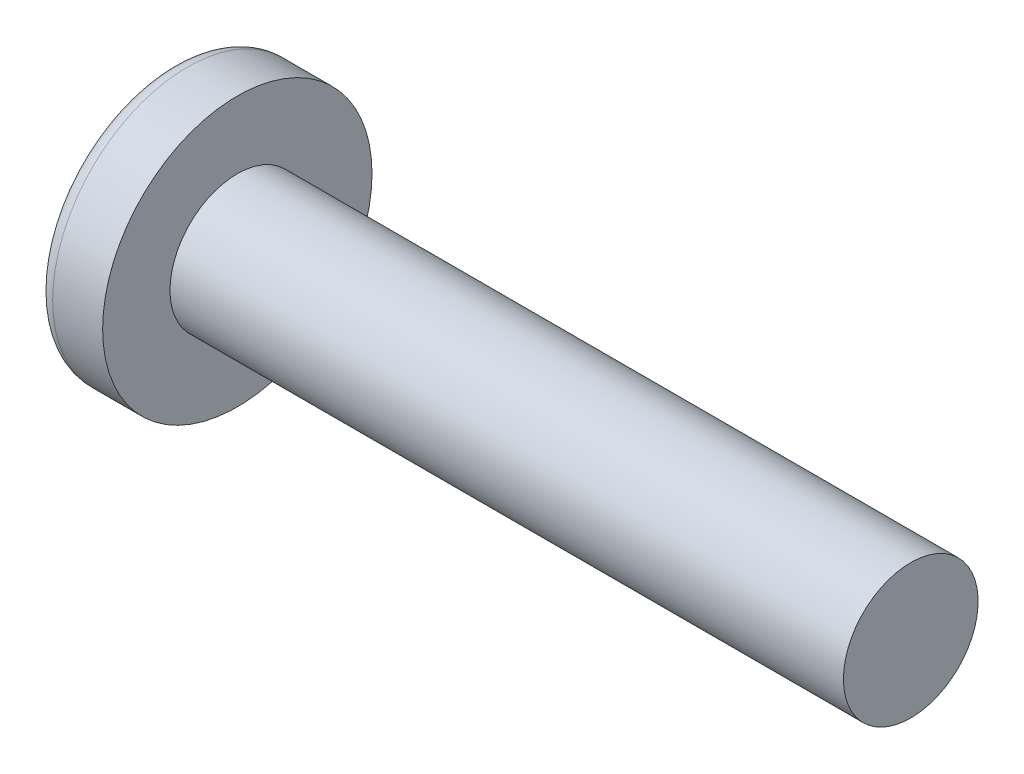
from build123d import *

# Parameters (mm, degrees)
CIRPATTERN1_COUNT = 2
CIRPATTERN1_ANGLE = 90


with BuildPart() as part:
    # BodySke → Base-Revolve (revolve)
    with BuildSketch(Plane.XY, mode=Mode.PRIVATE) as base_revolve_sk:
        with BuildLine():
            Line((3.1, 2), (3.1, 4))
            Line((3.1, 4), (1.616353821, 4))
            ThreePointArc((1.616353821, 4), (1.397629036, 3.947269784), (1.226960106, 3.800664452))
            ThreePointArc((1.226960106, 3.800664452), (0.314340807, 1.996902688), (0, 0))
            Line((0, 0), (23.1, 0))
            Line((23.1, 0), (23.1, 2))
            Line((23.1, 2), (3.1, 2))
        make_face()
    revolve(base_revolve_sk.sketch.rotate(Axis((-25.4, 0, 0), (1, 0, 0)), 90), axis=Axis((-25.4, 0, 0), (1, 0, 0)))

    # Sketch3 → Cut-Loft1 section 0
    with BuildSketch(Plane(origin=(0, 0, 0), x_dir=(0, 0, -1), z_dir=(1, 0, 0))):
        with BuildLine():
            Line((0.465, -2.2), (-0.465, -2.2))
            Line((-0.465, -2.2), (-0.465, 2.2))
            Line((-0.465, 2.2), (0.465, 2.2))
            Line((0.465, 2.2), (0.465, -2.2))
        make_face()
    # Sketch4 → Cut-Loft1 section 1
    with BuildSketch(Plane(origin=(2.45, 0, 0), x_dir=(0, 0, -1), z_dir=(1, 0, 0))):
        with BuildLine():
            Line((0.2325, -0.2325), (-0.2325, -0.2325))
            Line((-0.2325, -0.2325), (-0.2325, 0.2325))
            Line((-0.2325, 0.2325), (0.2325, 0.2325))
            Line((0.2325, 0.2325), (0.2325, -0.2325))
        make_face()
    cut_loft1 = loft(mode=Mode.SUBTRACT)

    # CirPattern1: Cut-Loft1 ×2 about axis
    cirpattern1_axis = Axis((0, 0, 0), (1, 0, 0))
    for i in range(1, CIRPATTERN1_COUNT):
        add(cut_loft1.rotate(cirpattern1_axis, i * CIRPATTERN1_ANGLE / (CIRPATTERN1_COUNT - 1)), mode=Mode.SUBTRACT)


solid = part.part
